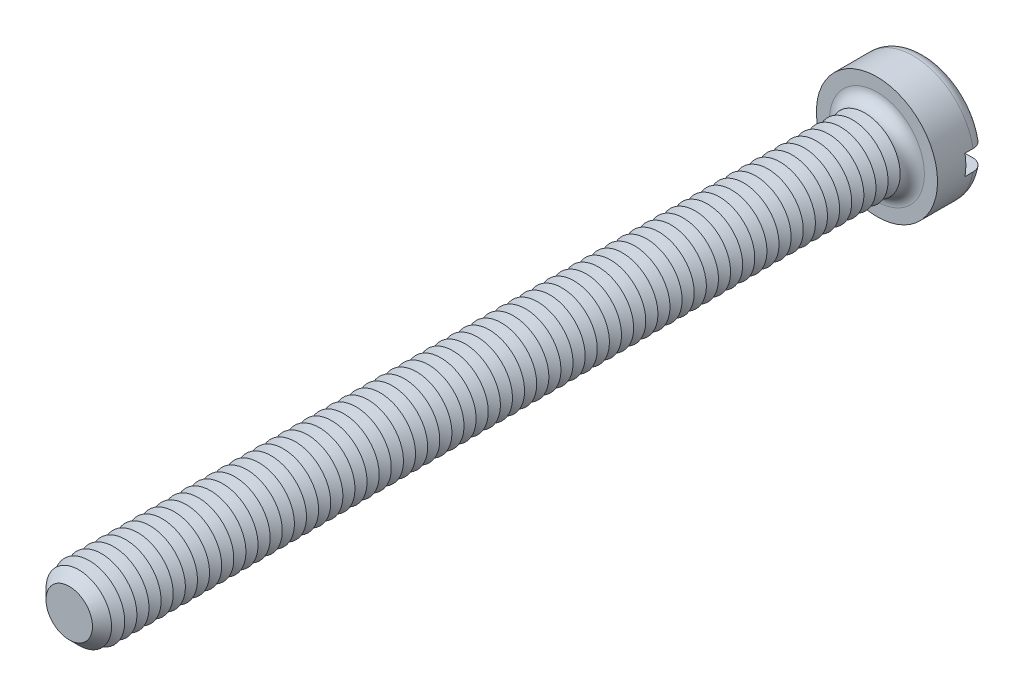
from build123d import *

# Parameters (mm, degrees)
SKETCH3_R           = 3
BOSS_EXTRUDE2_DEPTH = 2.4
SKETCH4_R           = 1.75
BOSS_EXTRUDE3_DEPTH = 40
FILLET1_R           = 0.6
CHAMFER1_SIZE       = 0.6
LPATTERN1_COUNT     = 65
LPATTERN1_PITCH     = 0.6
SKETCH8_W           = 6
SKETCH8_H           = 1
CUT_EXTRUDE1_DEPTH  = 1


with BuildPart() as part:
    # Sketch3 → Boss-Extrude2 (new body)
    with BuildSketch(Plane.XY):
        Circle(SKETCH3_R)
    extrude(amount=-BOSS_EXTRUDE2_DEPTH)

    # Sketch4 → Boss-Extrude3 (add)
    with BuildSketch(Plane.XY):
        Circle(SKETCH4_R)
    extrude(amount=BOSS_EXTRUDE3_DEPTH)

    # Fillet1
    fillet1_edges = [part.edges().sort_by_distance(p)[0] for p in [
        (-3, 0, -2.4),
        (-1.75, 0, 0),
    ]]
    fillet(fillet1_edges, radius=FILLET1_R)

    # Chamfer1
    chamfer1_edges = [part.edges().sort_by_distance(p)[0] for p in [
        (-1.75, 0, 40),
    ]]
    chamfer(chamfer1_edges, length=CHAMFER1_SIZE)

    # Sketch6 → Cut-Revolve1 (revolve, cut)
    with BuildSketch(Plane(origin=(0, 0, 0), x_dir=(0, 0, -1), z_dir=(1, 0, 0)), mode=Mode.PRIVATE) as cut_revolve1_sk:
        Polygon((-0.6, 1.75), (-0.9, 1.230384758), (-1.2, 1.75), align=None)
    cut_revolve1 = revolve(cut_revolve1_sk.sketch.rotate(Axis((0, 0, -1.694361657), (0, 0, 1)), 90), axis=Axis((0, 0, -1.694361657), (0, 0, 1)), mode=Mode.SUBTRACT)

    # LPattern1: Cut-Revolve1 ×65
    with Locations(*[(0, 0, i * LPATTERN1_PITCH) for i in range(1, LPATTERN1_COUNT)]):
        add(cut_revolve1, mode=Mode.SUBTRACT)

    # Sketch8 → Cut-Extrude1 (cut)
    with BuildSketch(Plane(origin=(0, 0, -2.4), x_dir=(-1, 0, 0), z_dir=(0, 0, -1))):
        Rectangle(SKETCH8_W, SKETCH8_H)
    extrude(amount=-CUT_EXTRUDE1_DEPTH, mode=Mode.SUBTRACT)


solid = part.part
